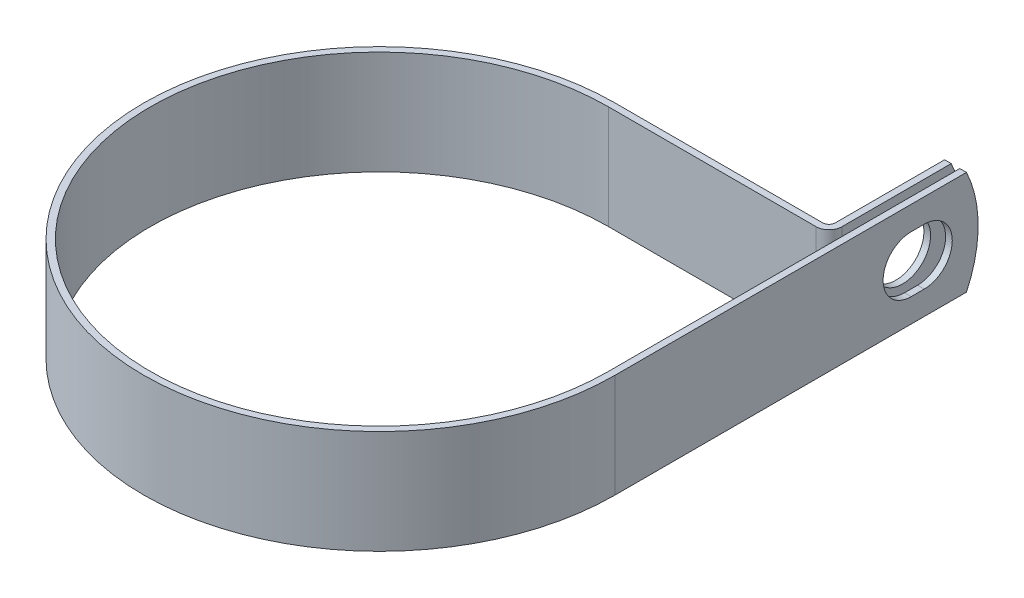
ISO-10303-21;
HEADER;
FILE_DESCRIPTION(('STEP AP214'),'2;1');
FILE_NAME('part.step','',(''),(''),'','','');
FILE_SCHEMA(('AUTOMOTIVE_DESIGN { 1 0 10303 214 1 1 1 1 }'));
ENDSEC;
DATA;
#1=APPLICATION_CONTEXT('core data for automotive mechanical design processes');
#2=APPLICATION_PROTOCOL_DEFINITION('international standard','automotive_design',2000,#1);
#3=PRODUCT_CONTEXT('',#1,'mechanical');
#4=PRODUCT('Part','Part','',(#3));
#5=PRODUCT_RELATED_PRODUCT_CATEGORY('part','',(#4));
#6=PRODUCT_DEFINITION_FORMATION('','',#4);
#7=PRODUCT_DEFINITION_CONTEXT('part definition',#1,'design');
#8=PRODUCT_DEFINITION('design','',#6,#7);
#9=PRODUCT_DEFINITION_SHAPE('','',#8);
#10=(LENGTH_UNIT() NAMED_UNIT(*) SI_UNIT(.MILLI.,.METRE.));
#11=(NAMED_UNIT(*) PLANE_ANGLE_UNIT() SI_UNIT($,.RADIAN.));
#12=(NAMED_UNIT(*) SI_UNIT($,.STERADIAN.) SOLID_ANGLE_UNIT());
#13=UNCERTAINTY_MEASURE_WITH_UNIT(LENGTH_MEASURE(1.E-05),#10,'distance_accuracy_value','');
#14=(GEOMETRIC_REPRESENTATION_CONTEXT(3) GLOBAL_UNCERTAINTY_ASSIGNED_CONTEXT((#13)) GLOBAL_UNIT_ASSIGNED_CONTEXT((#10,
#11,#12)) REPRESENTATION_CONTEXT('',''));
#15=CARTESIAN_POINT('',(0.,0.,0.));
#16=DIRECTION('',(0.,0.,1.));
#17=DIRECTION('',(1.,0.,0.));
#18=AXIS2_PLACEMENT_3D('',#15,#16,#17);
#19=CARTESIAN_POINT('',(42.0624,9.525,0.));
#20=DIRECTION('',(-1.,0.,0.));
#21=DIRECTION('',(0.,0.,1.));
#22=AXIS2_PLACEMENT_3D('',#19,#20,#21);
#23=PLANE('',#22);
#24=DIRECTION('',(0.,0.,-1.));
#25=VECTOR('',#24,1.);
#26=CARTESIAN_POINT('',(42.0624,-5.1562,-54.3559999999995));
#27=LINE('',#26,#25);
#28=CARTESIAN_POINT('',(42.0624,-5.1562,-54.3559999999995));
#29=VERTEX_POINT('',#28);
#30=CARTESIAN_POINT('',(42.0624,-5.1562,-56.7436000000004));
#31=VERTEX_POINT('',#30);
#32=EDGE_CURVE('E236',#29,#31,#27,.T.);
#33=ORIENTED_EDGE('',*,*,#32,.T.);
#34=CARTESIAN_POINT('',(42.0624,0.,-56.7435999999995));
#35=DIRECTION('',(-1.,0.,0.));
#36=DIRECTION('',(0.,0.,1.));
#37=AXIS2_PLACEMENT_3D('',#34,#35,#36);
#38=CIRCLE('',#37,5.1562);
#39=CARTESIAN_POINT('',(42.0624,5.1562,-56.7436000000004));
#40=VERTEX_POINT('',#39);
#41=EDGE_CURVE('E257',#31,#40,#38,.F.);
#42=ORIENTED_EDGE('',*,*,#41,.T.);
#43=DIRECTION('',(0.,0.,1.));
#44=VECTOR('',#43,1.);
#45=CARTESIAN_POINT('',(42.0624,5.1562,-54.3559999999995));
#46=LINE('',#45,#44);
#47=CARTESIAN_POINT('',(42.0624,5.1562,-54.3559999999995));
#48=VERTEX_POINT('',#47);
#49=EDGE_CURVE('E253',#40,#48,#46,.T.);
#50=ORIENTED_EDGE('',*,*,#49,.T.);
#51=CARTESIAN_POINT('',(42.0624,0.,-54.3559999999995));
#52=DIRECTION('',(-1.,0.,0.));
#53=DIRECTION('',(0.,0.,1.));
#54=AXIS2_PLACEMENT_3D('',#51,#52,#53);
#55=CIRCLE('',#54,5.1562);
#56=EDGE_CURVE('E248',#48,#29,#55,.F.);
#57=ORIENTED_EDGE('',*,*,#56,.T.);
#58=EDGE_LOOP('',(#33,#42,#50,#57));
#59=FACE_BOUND('',#58,.T.);
#60=CARTESIAN_POINT('',(42.0624,0.,-44.4246));
#61=DIRECTION('',(-1.,0.,0.));
#62=DIRECTION('',(0.,0.,1.));
#63=AXIS2_PLACEMENT_3D('',#60,#61,#62);
#64=CIRCLE('',#63,22.225);
#65=CARTESIAN_POINT('',(42.0624,9.525,-64.5050631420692));
#66=VERTEX_POINT('',#65);
#67=CARTESIAN_POINT('',(42.0624,-9.525,-64.5050631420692));
#68=VERTEX_POINT('',#67);
#69=EDGE_CURVE('E75',#66,#68,#64,.T.);
#70=ORIENTED_EDGE('',*,*,#69,.T.);
#71=DIRECTION('',(0.,0.,-1.));
#72=VECTOR('',#71,1.);
#73=CARTESIAN_POINT('',(42.0624,-9.525,0.));
#74=LINE('',#73,#72);
#75=CARTESIAN_POINT('',(42.0624,-9.525,0.));
#76=VERTEX_POINT('',#75);
#77=EDGE_CURVE('E271',#76,#68,#74,.T.);
#78=ORIENTED_EDGE('',*,*,#77,.F.);
#79=DIRECTION('',(0.,-1.,0.));
#80=VECTOR('',#79,1.);
#81=CARTESIAN_POINT('',(42.0624,9.525,0.));
#82=LINE('',#81,#80);
#83=CARTESIAN_POINT('',(42.0624,9.525,0.));
#84=VERTEX_POINT('',#83);
#85=EDGE_CURVE('E218',#84,#76,#82,.T.);
#86=ORIENTED_EDGE('',*,*,#85,.F.);
#87=DIRECTION('',(0.,0.,-1.));
#88=VECTOR('',#87,1.);
#89=CARTESIAN_POINT('',(42.0624,9.525,-42.0624));
#90=LINE('',#89,#88);
#91=EDGE_CURVE('E273',#84,#66,#90,.T.);
#92=ORIENTED_EDGE('',*,*,#91,.T.);
#93=EDGE_LOOP('',(#70,#78,#86,#92));
#94=FACE_BOUND('',#93,.T.);
#95=ADVANCED_FACE('F54',(#59,#94),#23,.T.);
#96=CARTESIAN_POINT('',(40.4876,9.525,-66.6496));
#97=DIRECTION('',(1.,0.,0.));
#98=DIRECTION('',(0.,0.,-1.));
#99=AXIS2_PLACEMENT_3D('',#96,#97,#98);
#100=PLANE('',#99);
#101=CARTESIAN_POINT('',(40.4876,0.,-55.5498));
#102=DIRECTION('',(1.,0.,0.));
#103=DIRECTION('',(0.,0.,-1.));
#104=AXIS2_PLACEMENT_3D('',#101,#102,#103);
#105=CIRCLE('',#104,5.1562);
#106=CARTESIAN_POINT('',(40.4876,0.,-60.706));
#107=VERTEX_POINT('',#106);
#108=EDGE_CURVE('E268',#107,#107,#105,.F.);
#109=ORIENTED_EDGE('',*,*,#108,.T.);
#110=EDGE_LOOP('',(#109));
#111=FACE_BOUND('',#110,.T.);
#112=DIRECTION('',(0.,0.,1.));
#113=VECTOR('',#112,1.);
#114=CARTESIAN_POINT('',(40.4876,-9.525,-66.6496));
#115=LINE('',#114,#113);
#116=CARTESIAN_POINT('',(40.4876,-9.525,-64.5050631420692));
#117=VERTEX_POINT('',#116);
#118=CARTESIAN_POINT('',(40.4876,-9.525,-44.43984));
#119=VERTEX_POINT('',#118);
#120=EDGE_CURVE('E184',#117,#119,#115,.T.);
#121=ORIENTED_EDGE('',*,*,#120,.F.);
#122=CARTESIAN_POINT('',(40.4876,0.,-44.4246));
#123=DIRECTION('',(1.,0.,0.));
#124=DIRECTION('',(0.,0.,-1.));
#125=AXIS2_PLACEMENT_3D('',#122,#123,#124);
#126=CIRCLE('',#125,22.225);
#127=CARTESIAN_POINT('',(40.4876,9.525,-64.5050631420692));
#128=VERTEX_POINT('',#127);
#129=EDGE_CURVE('E176',#117,#128,#126,.T.);
#130=ORIENTED_EDGE('',*,*,#129,.T.);
#131=DIRECTION('',(0.,0.,1.));
#132=VECTOR('',#131,1.);
#133=CARTESIAN_POINT('',(40.4876,9.525,-66.6496));
#134=LINE('',#133,#132);
#135=CARTESIAN_POINT('',(40.4876,9.525,-44.43984));
#136=VERTEX_POINT('',#135);
#137=EDGE_CURVE('E224',#128,#136,#134,.T.);
#138=ORIENTED_EDGE('',*,*,#137,.T.);
#139=DIRECTION('',(0.,-1.,0.));
#140=VECTOR('',#139,1.);
#141=CARTESIAN_POINT('',(40.4876,9.525,-44.43984));
#142=LINE('',#141,#140);
#143=EDGE_CURVE('E211',#136,#119,#142,.T.);
#144=ORIENTED_EDGE('',*,*,#143,.T.);
#145=EDGE_LOOP('',(#121,#130,#138,#144));
#146=FACE_BOUND('',#145,.T.);
#147=ADVANCED_FACE('F226',(#111,#146),#100,.T.);
#148=CARTESIAN_POINT('',(39.2684,9.525,-66.6496));
#149=DIRECTION('',(1.,0.,0.));
#150=DIRECTION('',(0.,0.,-1.));
#151=AXIS2_PLACEMENT_3D('',#148,#149,#150);
#152=PLANE('',#151);
#153=CARTESIAN_POINT('',(39.2684,0.,-55.5498));
#154=DIRECTION('',(-1.,0.,0.));
#155=DIRECTION('',(0.,0.,1.));
#156=AXIS2_PLACEMENT_3D('',#153,#154,#155);
#157=CIRCLE('',#156,5.1562);
#158=CARTESIAN_POINT('',(39.2684,0.,-50.3936));
#159=VERTEX_POINT('',#158);
#160=EDGE_CURVE('E265',#159,#159,#157,.T.);
#161=ORIENTED_EDGE('',*,*,#160,.F.);
#162=EDGE_LOOP('',(#161));
#163=FACE_BOUND('',#162,.T.);
#164=CARTESIAN_POINT('',(39.2684,0.,-44.4246));
#165=DIRECTION('',(-1.,0.,0.));
#166=DIRECTION('',(0.,0.,1.));
#167=AXIS2_PLACEMENT_3D('',#164,#165,#166);
#168=CIRCLE('',#167,22.225);
#169=CARTESIAN_POINT('',(39.2684,9.525,-64.5050631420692));
#170=VERTEX_POINT('',#169);
#171=CARTESIAN_POINT('',(39.2684,-9.525,-64.5050631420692));
#172=VERTEX_POINT('',#171);
#173=EDGE_CURVE('E67',#170,#172,#168,.T.);
#174=ORIENTED_EDGE('',*,*,#173,.T.);
#175=DIRECTION('',(0.,0.,1.));
#176=VECTOR('',#175,1.);
#177=CARTESIAN_POINT('',(39.2684,-9.525,-66.6496));
#178=LINE('',#177,#176);
#179=CARTESIAN_POINT('',(39.2684,-9.525,-44.43984));
#180=VERTEX_POINT('',#179);
#181=EDGE_CURVE('E167',#172,#180,#178,.T.);
#182=ORIENTED_EDGE('',*,*,#181,.T.);
#183=DIRECTION('',(0.,-1.,0.));
#184=VECTOR('',#183,1.);
#185=CARTESIAN_POINT('',(39.2684,9.525,-44.43984));
#186=LINE('',#185,#184);
#187=CARTESIAN_POINT('',(39.2684,9.525,-44.43984));
#188=VERTEX_POINT('',#187);
#189=EDGE_CURVE('E209',#188,#180,#186,.T.);
#190=ORIENTED_EDGE('',*,*,#189,.F.);
#191=DIRECTION('',(0.,0.,1.));
#192=VECTOR('',#191,1.);
#193=CARTESIAN_POINT('',(39.2684,9.525,-66.6496));
#194=LINE('',#193,#192);
#195=EDGE_CURVE('E169',#170,#188,#194,.T.);
#196=ORIENTED_EDGE('',*,*,#195,.F.);
#197=EDGE_LOOP('',(#174,#182,#190,#196));
#198=FACE_BOUND('',#197,.T.);
#199=ADVANCED_FACE('F164',(#163,#198),#152,.F.);
#200=CARTESIAN_POINT('',(43.2816,9.525,0.));
#201=DIRECTION('',(-1.,0.,0.));
#202=DIRECTION('',(0.,0.,1.));
#203=AXIS2_PLACEMENT_3D('',#200,#201,#202);
#204=PLANE('',#203);
#205=CARTESIAN_POINT('',(43.2816,0.,-56.7435999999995));
#206=DIRECTION('',(1.,0.,0.));
#207=DIRECTION('',(0.,0.,-1.));
#208=AXIS2_PLACEMENT_3D('',#205,#206,#207);
#209=CIRCLE('',#208,5.1562);
#210=CARTESIAN_POINT('',(43.2816,-5.1562,-56.7436000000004));
#211=VERTEX_POINT('',#210);
#212=CARTESIAN_POINT('',(43.2816,5.1562,-56.7436000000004));
#213=VERTEX_POINT('',#212);
#214=EDGE_CURVE('E237',#211,#213,#209,.T.);
#215=ORIENTED_EDGE('',*,*,#214,.F.);
#216=DIRECTION('',(0.,0.,-1.));
#217=VECTOR('',#216,1.);
#218=CARTESIAN_POINT('',(43.2816,-5.1562,-54.3559999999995));
#219=LINE('',#218,#217);
#220=CARTESIAN_POINT('',(43.2816,-5.1562,-54.3559999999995));
#221=VERTEX_POINT('',#220);
#222=EDGE_CURVE('E240',#221,#211,#219,.T.);
#223=ORIENTED_EDGE('',*,*,#222,.F.);
#224=CARTESIAN_POINT('',(43.2816,0.,-54.3559999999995));
#225=DIRECTION('',(1.,0.,0.));
#226=DIRECTION('',(0.,0.,-1.));
#227=AXIS2_PLACEMENT_3D('',#224,#225,#226);
#228=CIRCLE('',#227,5.1562);
#229=CARTESIAN_POINT('',(43.2816,5.1562,-54.3559999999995));
#230=VERTEX_POINT('',#229);
#231=EDGE_CURVE('E230',#230,#221,#228,.T.);
#232=ORIENTED_EDGE('',*,*,#231,.F.);
#233=DIRECTION('',(0.,0.,1.));
#234=VECTOR('',#233,1.);
#235=CARTESIAN_POINT('',(43.2816,5.1562,-54.3559999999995));
#236=LINE('',#235,#234);
#237=EDGE_CURVE('E234',#213,#230,#236,.T.);
#238=ORIENTED_EDGE('',*,*,#237,.F.);
#239=EDGE_LOOP('',(#215,#223,#232,#238));
#240=FACE_BOUND('',#239,.T.);
#241=DIRECTION('',(0.,0.,-1.));
#242=VECTOR('',#241,1.);
#243=CARTESIAN_POINT('',(43.2816,-9.525,0.));
#244=LINE('',#243,#242);
#245=CARTESIAN_POINT('',(43.2816,-9.525,0.));
#246=VERTEX_POINT('',#245);
#247=CARTESIAN_POINT('',(43.2816,-9.525,-64.5050631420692));
#248=VERTEX_POINT('',#247);
#249=EDGE_CURVE('E195',#246,#248,#244,.T.);
#250=ORIENTED_EDGE('',*,*,#249,.T.);
#251=CARTESIAN_POINT('',(43.2816,0.,-44.4246));
#252=DIRECTION('',(-1.,0.,0.));
#253=DIRECTION('',(0.,0.,1.));
#254=AXIS2_PLACEMENT_3D('',#251,#252,#253);
#255=CIRCLE('',#254,22.225);
#256=CARTESIAN_POINT('',(43.2816,9.525,-64.5050631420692));
#257=VERTEX_POINT('',#256);
#258=EDGE_CURVE('E170',#257,#248,#255,.T.);
#259=ORIENTED_EDGE('',*,*,#258,.F.);
#260=DIRECTION('',(0.,0.,-1.));
#261=VECTOR('',#260,1.);
#262=CARTESIAN_POINT('',(43.2816,9.525,-42.0624));
#263=LINE('',#262,#261);
#264=CARTESIAN_POINT('',(43.2816,9.525,0.));
#265=VERTEX_POINT('',#264);
#266=EDGE_CURVE('E198',#265,#257,#263,.T.);
#267=ORIENTED_EDGE('',*,*,#266,.F.);
#268=DIRECTION('',(0.,-1.,0.));
#269=VECTOR('',#268,1.);
#270=CARTESIAN_POINT('',(43.2816,9.525,0.));
#271=LINE('',#270,#269);
#272=EDGE_CURVE('E199',#265,#246,#271,.T.);
#273=ORIENTED_EDGE('',*,*,#272,.T.);
#274=EDGE_LOOP('',(#250,#259,#267,#273));
#275=FACE_BOUND('',#274,.T.);
#276=ADVANCED_FACE('F321',(#240,#275),#204,.F.);
#277=CARTESIAN_POINT('',(0.,-9.525,0.));
#278=DIRECTION('',(0.,1.,0.));
#279=DIRECTION('',(1.,0.,0.));
#280=AXIS2_PLACEMENT_3D('',#277,#278,#279);
#281=PLANE('',#280);
#282=DIRECTION('',(-1.,0.,0.));
#283=VECTOR('',#282,1.);
#284=CARTESIAN_POINT('',(43.2816,-9.525,-64.5050631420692));
#285=LINE('',#284,#283);
#286=EDGE_CURVE('E171',#248,#68,#285,.T.);
#287=ORIENTED_EDGE('',*,*,#286,.F.);
#288=ORIENTED_EDGE('',*,*,#249,.F.);
#289=CARTESIAN_POINT('',(0.,-9.525,0.));
#290=DIRECTION('',(0.,1.,0.));
#291=DIRECTION('',(1.,0.,0.));
#292=AXIS2_PLACEMENT_3D('',#289,#290,#291);
#293=CIRCLE('',#292,43.2816);
#294=CARTESIAN_POINT('',(0.,-9.525,-43.2816));
#295=VERTEX_POINT('',#294);
#296=EDGE_CURVE('E193',#295,#246,#293,.T.);
#297=ORIENTED_EDGE('',*,*,#296,.F.);
#298=DIRECTION('',(1.,0.,0.));
#299=VECTOR('',#298,1.);
#300=CARTESIAN_POINT('',(0.,-9.525,-43.2816));
#301=LINE('',#300,#299);
#302=CARTESIAN_POINT('',(38.11016,-9.525,-43.2816));
#303=VERTEX_POINT('',#302);
#304=EDGE_CURVE('E186',#303,#295,#301,.F.);
#305=ORIENTED_EDGE('',*,*,#304,.F.);
#306=CARTESIAN_POINT('',(38.11016,-9.525,-44.43984));
#307=DIRECTION('',(0.,1.,0.));
#308=DIRECTION('',(1.,0.,0.));
#309=AXIS2_PLACEMENT_3D('',#306,#307,#308);
#310=CIRCLE('',#309,1.15824);
#311=EDGE_CURVE('E183',#180,#303,#310,.F.);
#312=ORIENTED_EDGE('',*,*,#311,.F.);
#313=ORIENTED_EDGE('',*,*,#181,.F.);
#314=DIRECTION('',(-1.,0.,0.));
#315=VECTOR('',#314,1.);
#316=CARTESIAN_POINT('',(43.2816,-9.525,-64.5050631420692));
#317=LINE('',#316,#315);
#318=EDGE_CURVE('E12',#117,#172,#317,.T.);
#319=ORIENTED_EDGE('',*,*,#318,.F.);
#320=ORIENTED_EDGE('',*,*,#120,.T.);
#321=CARTESIAN_POINT('',(38.11016,-9.525,-44.43984));
#322=DIRECTION('',(0.,-1.,0.));
#323=DIRECTION('',(0.,0.,1.));
#324=AXIS2_PLACEMENT_3D('',#321,#322,#323);
#325=CIRCLE('',#324,2.37744);
#326=CARTESIAN_POINT('',(38.11016,-9.525,-42.0624));
#327=VERTEX_POINT('',#326);
#328=EDGE_CURVE('E188',#119,#327,#325,.T.);
#329=ORIENTED_EDGE('',*,*,#328,.T.);
#330=DIRECTION('',(-1.,0.,0.));
#331=VECTOR('',#330,1.);
#332=CARTESIAN_POINT('',(0.,-9.525,-42.0624));
#333=LINE('',#332,#331);
#334=CARTESIAN_POINT('',(0.,-9.525,-42.0624));
#335=VERTEX_POINT('',#334);
#336=EDGE_CURVE('E298',#327,#335,#333,.T.);
#337=ORIENTED_EDGE('',*,*,#336,.T.);
#338=CARTESIAN_POINT('',(0.,-9.525,0.));
#339=DIRECTION('',(0.,1.,0.));
#340=DIRECTION('',(0.,0.,1.));
#341=AXIS2_PLACEMENT_3D('',#338,#339,#340);
#342=CIRCLE('',#341,42.0624);
#343=EDGE_CURVE('E295',#335,#76,#342,.T.);
#344=ORIENTED_EDGE('',*,*,#343,.T.);
#345=ORIENTED_EDGE('',*,*,#77,.T.);
#346=EDGE_LOOP('',(#287,#288,#297,#305,#312,#313,#319,#320,#329,#337,#344,#345));
#347=FACE_BOUND('',#346,.T.);
#348=ADVANCED_FACE('F181',(#347),#281,.F.);
#349=CARTESIAN_POINT('',(0.,9.525,0.));
#350=DIRECTION('',(0.,1.,0.));
#351=DIRECTION('',(1.,0.,0.));
#352=AXIS2_PLACEMENT_3D('',#349,#350,#351);
#353=PLANE('',#352);
#354=ORIENTED_EDGE('',*,*,#266,.T.);
#355=DIRECTION('',(-1.,0.,0.));
#356=VECTOR('',#355,1.);
#357=CARTESIAN_POINT('',(43.2816,9.525,-64.5050631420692));
#358=LINE('',#357,#356);
#359=EDGE_CURVE('E228',#257,#66,#358,.T.);
#360=ORIENTED_EDGE('',*,*,#359,.T.);
#361=ORIENTED_EDGE('',*,*,#91,.F.);
#362=CARTESIAN_POINT('',(0.,9.525,0.));
#363=DIRECTION('',(0.,1.,0.));
#364=DIRECTION('',(0.,0.,1.));
#365=AXIS2_PLACEMENT_3D('',#362,#363,#364);
#366=CIRCLE('',#365,42.0624);
#367=CARTESIAN_POINT('',(0.,9.525,-42.0624));
#368=VERTEX_POINT('',#367);
#369=EDGE_CURVE('E276',#368,#84,#366,.T.);
#370=ORIENTED_EDGE('',*,*,#369,.F.);
#371=DIRECTION('',(-1.,0.,0.));
#372=VECTOR('',#371,1.);
#373=CARTESIAN_POINT('',(0.,9.525,-42.0624));
#374=LINE('',#373,#372);
#375=CARTESIAN_POINT('',(38.11016,9.525,-42.0624));
#376=VERTEX_POINT('',#375);
#377=EDGE_CURVE('E279',#376,#368,#374,.T.);
#378=ORIENTED_EDGE('',*,*,#377,.F.);
#379=CARTESIAN_POINT('',(38.11016,9.525,-44.43984));
#380=DIRECTION('',(0.,-1.,0.));
#381=DIRECTION('',(0.,0.,1.));
#382=AXIS2_PLACEMENT_3D('',#379,#380,#381);
#383=CIRCLE('',#382,2.37744);
#384=EDGE_CURVE('E282',#136,#376,#383,.T.);
#385=ORIENTED_EDGE('',*,*,#384,.F.);
#386=ORIENTED_EDGE('',*,*,#137,.F.);
#387=DIRECTION('',(-1.,0.,0.));
#388=VECTOR('',#387,1.);
#389=CARTESIAN_POINT('',(43.2816,9.525,-64.5050631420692));
#390=LINE('',#389,#388);
#391=EDGE_CURVE('E61',#128,#170,#390,.T.);
#392=ORIENTED_EDGE('',*,*,#391,.T.);
#393=ORIENTED_EDGE('',*,*,#195,.T.);
#394=CARTESIAN_POINT('',(38.11016,9.525,-44.43984));
#395=DIRECTION('',(0.,1.,0.));
#396=DIRECTION('',(1.,0.,0.));
#397=AXIS2_PLACEMENT_3D('',#394,#395,#396);
#398=CIRCLE('',#397,1.15824);
#399=CARTESIAN_POINT('',(38.11016,9.525,-43.2816));
#400=VERTEX_POINT('',#399);
#401=EDGE_CURVE('E287',#188,#400,#398,.F.);
#402=ORIENTED_EDGE('',*,*,#401,.T.);
#403=DIRECTION('',(1.,0.,0.));
#404=VECTOR('',#403,1.);
#405=CARTESIAN_POINT('',(0.,9.525,-43.2816));
#406=LINE('',#405,#404);
#407=CARTESIAN_POINT('',(0.,9.525,-43.2816));
#408=VERTEX_POINT('',#407);
#409=EDGE_CURVE('E289',#400,#408,#406,.F.);
#410=ORIENTED_EDGE('',*,*,#409,.T.);
#411=CARTESIAN_POINT('',(0.,9.525,0.));
#412=DIRECTION('',(0.,1.,0.));
#413=DIRECTION('',(1.,0.,0.));
#414=AXIS2_PLACEMENT_3D('',#411,#412,#413);
#415=CIRCLE('',#414,43.2816);
#416=EDGE_CURVE('E203',#408,#265,#415,.T.);
#417=ORIENTED_EDGE('',*,*,#416,.T.);
#418=EDGE_LOOP('',(#354,#360,#361,#370,#378,#385,#386,#392,#393,#402,#410,#417));
#419=FACE_BOUND('',#418,.T.);
#420=ADVANCED_FACE('F222',(#419),#353,.T.);
#421=CARTESIAN_POINT('',(0.,9.525,0.));
#422=DIRECTION('',(0.,-1.,0.));
#423=DIRECTION('',(0.,0.,-1.));
#424=AXIS2_PLACEMENT_3D('',#421,#422,#423);
#425=CYLINDRICAL_SURFACE('',#424,42.0624);
#426=ORIENTED_EDGE('',*,*,#343,.F.);
#427=DIRECTION('',(0.,-1.,0.));
#428=VECTOR('',#427,1.);
#429=CARTESIAN_POINT('',(0.,9.525,-42.0624));
#430=LINE('',#429,#428);
#431=EDGE_CURVE('E216',#368,#335,#430,.T.);
#432=ORIENTED_EDGE('',*,*,#431,.F.);
#433=ORIENTED_EDGE('',*,*,#369,.T.);
#434=ORIENTED_EDGE('',*,*,#85,.T.);
#435=EDGE_LOOP('',(#426,#432,#433,#434));
#436=FACE_BOUND('',#435,.T.);
#437=ADVANCED_FACE('F311',(#436),#425,.F.);
#438=CARTESIAN_POINT('',(0.,9.525,-42.0624));
#439=DIRECTION('',(0.,0.,1.));
#440=DIRECTION('',(1.,0.,0.));
#441=AXIS2_PLACEMENT_3D('',#438,#439,#440);
#442=PLANE('',#441);
#443=ORIENTED_EDGE('',*,*,#336,.F.);
#444=DIRECTION('',(0.,-1.,0.));
#445=VECTOR('',#444,1.);
#446=CARTESIAN_POINT('',(38.11016,9.525,-42.0624));
#447=LINE('',#446,#445);
#448=EDGE_CURVE('E214',#376,#327,#447,.T.);
#449=ORIENTED_EDGE('',*,*,#448,.F.);
#450=ORIENTED_EDGE('',*,*,#377,.T.);
#451=ORIENTED_EDGE('',*,*,#431,.T.);
#452=EDGE_LOOP('',(#443,#449,#450,#451));
#453=FACE_BOUND('',#452,.T.);
#454=ADVANCED_FACE('F307',(#453),#442,.T.);
#455=CARTESIAN_POINT('',(38.11016,9.525,-44.43984));
#456=DIRECTION('',(0.,-1.,0.));
#457=DIRECTION('',(0.,0.,-1.));
#458=AXIS2_PLACEMENT_3D('',#455,#456,#457);
#459=CYLINDRICAL_SURFACE('',#458,2.37744);
#460=ORIENTED_EDGE('',*,*,#328,.F.);
#461=ORIENTED_EDGE('',*,*,#143,.F.);
#462=ORIENTED_EDGE('',*,*,#384,.T.);
#463=ORIENTED_EDGE('',*,*,#448,.T.);
#464=EDGE_LOOP('',(#460,#461,#462,#463));
#465=FACE_BOUND('',#464,.T.);
#466=ADVANCED_FACE('F304',(#465),#459,.T.);
#467=CARTESIAN_POINT('',(38.11016,9.525,-44.43984));
#468=DIRECTION('',(0.,-1.,0.));
#469=DIRECTION('',(0.,0.,-1.));
#470=AXIS2_PLACEMENT_3D('',#467,#468,#469);
#471=CYLINDRICAL_SURFACE('',#470,1.15824);
#472=ORIENTED_EDGE('',*,*,#311,.T.);
#473=DIRECTION('',(0.,-1.,0.));
#474=VECTOR('',#473,1.);
#475=CARTESIAN_POINT('',(38.11016,9.525,-43.2816));
#476=LINE('',#475,#474);
#477=EDGE_CURVE('E206',#400,#303,#476,.T.);
#478=ORIENTED_EDGE('',*,*,#477,.F.);
#479=ORIENTED_EDGE('',*,*,#401,.F.);
#480=ORIENTED_EDGE('',*,*,#189,.T.);
#481=EDGE_LOOP('',(#472,#478,#479,#480));
#482=FACE_BOUND('',#481,.T.);
#483=ADVANCED_FACE('F334',(#482),#471,.F.);
#484=CARTESIAN_POINT('',(0.,9.525,-43.2816));
#485=DIRECTION('',(0.,0.,1.));
#486=DIRECTION('',(1.,0.,0.));
#487=AXIS2_PLACEMENT_3D('',#484,#485,#486);
#488=PLANE('',#487);
#489=ORIENTED_EDGE('',*,*,#304,.T.);
#490=DIRECTION('',(0.,-1.,0.));
#491=VECTOR('',#490,1.);
#492=CARTESIAN_POINT('',(0.,9.525,-43.2816));
#493=LINE('',#492,#491);
#494=EDGE_CURVE('E202',#408,#295,#493,.T.);
#495=ORIENTED_EDGE('',*,*,#494,.F.);
#496=ORIENTED_EDGE('',*,*,#409,.F.);
#497=ORIENTED_EDGE('',*,*,#477,.T.);
#498=EDGE_LOOP('',(#489,#495,#496,#497));
#499=FACE_BOUND('',#498,.T.);
#500=ADVANCED_FACE('F330',(#499),#488,.F.);
#501=CARTESIAN_POINT('',(0.,9.525,0.));
#502=DIRECTION('',(0.,-1.,0.));
#503=DIRECTION('',(0.,0.,-1.));
#504=AXIS2_PLACEMENT_3D('',#501,#502,#503);
#505=CYLINDRICAL_SURFACE('',#504,43.2816);
#506=ORIENTED_EDGE('',*,*,#296,.T.);
#507=ORIENTED_EDGE('',*,*,#272,.F.);
#508=ORIENTED_EDGE('',*,*,#416,.F.);
#509=ORIENTED_EDGE('',*,*,#494,.T.);
#510=EDGE_LOOP('',(#506,#507,#508,#509));
#511=FACE_BOUND('',#510,.T.);
#512=ADVANCED_FACE('F327',(#511),#505,.T.);
#513=CARTESIAN_POINT('',(55.0715359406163,0.,-55.5498));
#514=DIRECTION('',(-1.,0.,0.));
#515=DIRECTION('',(0.,0.,1.));
#516=AXIS2_PLACEMENT_3D('',#513,#514,#515);
#517=CYLINDRICAL_SURFACE('',#516,5.1562);
#518=ORIENTED_EDGE('',*,*,#160,.T.);
#519=EDGE_LOOP('',(#518));
#520=FACE_BOUND('',#519,.T.);
#521=ORIENTED_EDGE('',*,*,#108,.F.);
#522=EDGE_LOOP('',(#521));
#523=FACE_BOUND('',#522,.T.);
#524=ADVANCED_FACE('F379',(#520,#523),#517,.F.);
#525=CARTESIAN_POINT('',(25.70282806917,-5.1562,-54.3559999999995));
#526=DIRECTION('',(0.,-1.,0.));
#527=DIRECTION('',(0.,0.,-1.));
#528=AXIS2_PLACEMENT_3D('',#525,#526,#527);
#529=PLANE('',#528);
#530=DIRECTION('',(1.,0.,0.));
#531=VECTOR('',#530,1.);
#532=CARTESIAN_POINT('',(25.70282806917,-5.1562,-54.3559999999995));
#533=LINE('',#532,#531);
#534=EDGE_CURVE('E251',#29,#221,#533,.T.);
#535=ORIENTED_EDGE('',*,*,#534,.T.);
#536=ORIENTED_EDGE('',*,*,#222,.T.);
#537=DIRECTION('',(1.,0.,0.));
#538=VECTOR('',#537,1.);
#539=CARTESIAN_POINT('',(25.70282806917,-5.1562,-56.7436000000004));
#540=LINE('',#539,#538);
#541=EDGE_CURVE('E247',#31,#211,#540,.T.);
#542=ORIENTED_EDGE('',*,*,#541,.F.);
#543=ORIENTED_EDGE('',*,*,#32,.F.);
#544=EDGE_LOOP('',(#535,#536,#542,#543));
#545=FACE_BOUND('',#544,.T.);
#546=ADVANCED_FACE('F354',(#545),#529,.F.);
#547=CARTESIAN_POINT('',(25.70282806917,0.,-56.7435999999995));
#548=DIRECTION('',(1.,0.,0.));
#549=DIRECTION('',(0.,0.,-1.));
#550=AXIS2_PLACEMENT_3D('',#547,#548,#549);
#551=CYLINDRICAL_SURFACE('',#550,5.1562);
#552=ORIENTED_EDGE('',*,*,#541,.T.);
#553=ORIENTED_EDGE('',*,*,#214,.T.);
#554=DIRECTION('',(1.,0.,0.));
#555=VECTOR('',#554,1.);
#556=CARTESIAN_POINT('',(25.70282806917,5.1562,-56.7436000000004));
#557=LINE('',#556,#555);
#558=EDGE_CURVE('E256',#40,#213,#557,.T.);
#559=ORIENTED_EDGE('',*,*,#558,.F.);
#560=ORIENTED_EDGE('',*,*,#41,.F.);
#561=EDGE_LOOP('',(#552,#553,#559,#560));
#562=FACE_BOUND('',#561,.T.);
#563=ADVANCED_FACE('F358',(#562),#551,.F.);
#564=CARTESIAN_POINT('',(25.70282806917,5.1562,-54.3559999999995));
#565=DIRECTION('',(0.,1.,0.));
#566=DIRECTION('',(0.,0.,1.));
#567=AXIS2_PLACEMENT_3D('',#564,#565,#566);
#568=PLANE('',#567);
#569=ORIENTED_EDGE('',*,*,#558,.T.);
#570=ORIENTED_EDGE('',*,*,#237,.T.);
#571=DIRECTION('',(1.,0.,0.));
#572=VECTOR('',#571,1.);
#573=CARTESIAN_POINT('',(25.70282806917,5.1562,-54.3559999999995));
#574=LINE('',#573,#572);
#575=EDGE_CURVE('E252',#48,#230,#574,.T.);
#576=ORIENTED_EDGE('',*,*,#575,.F.);
#577=ORIENTED_EDGE('',*,*,#49,.F.);
#578=EDGE_LOOP('',(#569,#570,#576,#577));
#579=FACE_BOUND('',#578,.T.);
#580=ADVANCED_FACE('F362',(#579),#568,.F.);
#581=CARTESIAN_POINT('',(25.70282806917,0.,-54.3559999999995));
#582=DIRECTION('',(1.,0.,0.));
#583=DIRECTION('',(0.,0.,-1.));
#584=AXIS2_PLACEMENT_3D('',#581,#582,#583);
#585=CYLINDRICAL_SURFACE('',#584,5.1562);
#586=ORIENTED_EDGE('',*,*,#575,.T.);
#587=ORIENTED_EDGE('',*,*,#231,.T.);
#588=ORIENTED_EDGE('',*,*,#534,.F.);
#589=ORIENTED_EDGE('',*,*,#56,.F.);
#590=EDGE_LOOP('',(#586,#587,#588,#589));
#591=FACE_BOUND('',#590,.T.);
#592=ADVANCED_FACE('F366',(#591),#585,.F.);
#593=CARTESIAN_POINT('',(43.2816,0.,-44.4246));
#594=DIRECTION('',(-1.,0.,0.));
#595=DIRECTION('',(0.,0.,1.));
#596=AXIS2_PLACEMENT_3D('',#593,#594,#595);
#597=CYLINDRICAL_SURFACE('',#596,22.225);
#598=ORIENTED_EDGE('',*,*,#129,.F.);
#599=ORIENTED_EDGE('',*,*,#318,.T.);
#600=ORIENTED_EDGE('',*,*,#173,.F.);
#601=ORIENTED_EDGE('',*,*,#391,.F.);
#602=EDGE_LOOP('',(#598,#599,#600,#601));
#603=FACE_BOUND('',#602,.T.);
#604=ADVANCED_FACE('F174',(#603),#597,.T.);
#605=ORIENTED_EDGE('',*,*,#359,.F.);
#606=ORIENTED_EDGE('',*,*,#258,.T.);
#607=ORIENTED_EDGE('',*,*,#286,.T.);
#608=ORIENTED_EDGE('',*,*,#69,.F.);
#609=EDGE_LOOP('',(#605,#606,#607,#608));
#610=FACE_BOUND('',#609,.T.);
#611=ADVANCED_FACE('F316',(#610),#597,.T.);
#612=CLOSED_SHELL('',(#95,#147,#199,#276,#348,#420,#437,#454,#466,#483,#500,#512,#524,#546,#563,
#580,#592,#604,#611));
#613=MANIFOLD_SOLID_BREP('B2',#612);
#614=ADVANCED_BREP_SHAPE_REPRESENTATION('',(#18,#613),#14);
#615=SHAPE_DEFINITION_REPRESENTATION(#9,#614);
ENDSEC;
END-ISO-10303-21;
